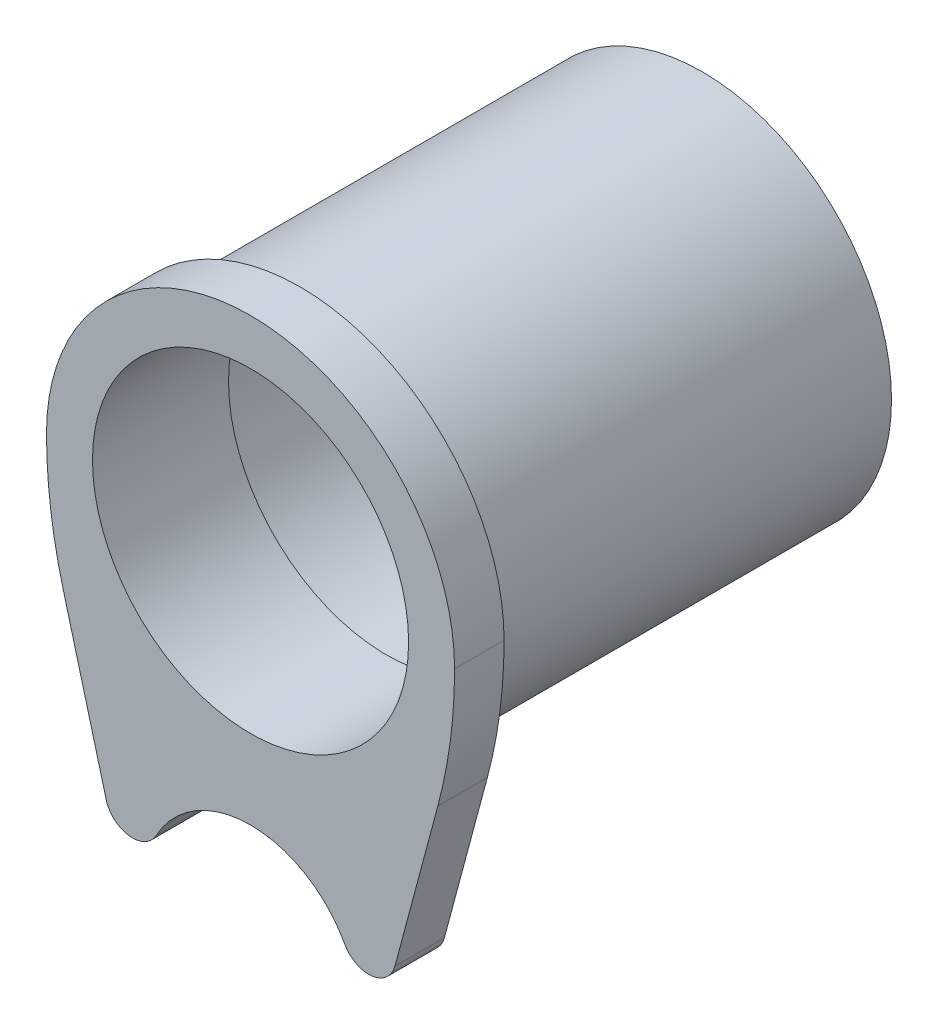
ISO-10303-21;
HEADER;
FILE_DESCRIPTION(('STEP AP214'),'2;1');
FILE_NAME('part.step','',(''),(''),'','','');
FILE_SCHEMA(('AUTOMOTIVE_DESIGN { 1 0 10303 214 1 1 1 1 }'));
ENDSEC;
DATA;
#1=APPLICATION_CONTEXT('core data for automotive mechanical design processes');
#2=APPLICATION_PROTOCOL_DEFINITION('international standard','automotive_design',2000,#1);
#3=PRODUCT_CONTEXT('',#1,'mechanical');
#4=PRODUCT('Part','Part','',(#3));
#5=PRODUCT_RELATED_PRODUCT_CATEGORY('part','',(#4));
#6=PRODUCT_DEFINITION_FORMATION('','',#4);
#7=PRODUCT_DEFINITION_CONTEXT('part definition',#1,'design');
#8=PRODUCT_DEFINITION('design','',#6,#7);
#9=PRODUCT_DEFINITION_SHAPE('','',#8);
#10=(LENGTH_UNIT() NAMED_UNIT(*) SI_UNIT(.MILLI.,.METRE.));
#11=(NAMED_UNIT(*) PLANE_ANGLE_UNIT() SI_UNIT($,.RADIAN.));
#12=(NAMED_UNIT(*) SI_UNIT($,.STERADIAN.) SOLID_ANGLE_UNIT());
#13=UNCERTAINTY_MEASURE_WITH_UNIT(LENGTH_MEASURE(1.E-05),#10,'distance_accuracy_value','');
#14=(GEOMETRIC_REPRESENTATION_CONTEXT(3) GLOBAL_UNCERTAINTY_ASSIGNED_CONTEXT((#13)) GLOBAL_UNIT_ASSIGNED_CONTEXT((#10,
#11,#12)) REPRESENTATION_CONTEXT('',''));
#15=CARTESIAN_POINT('',(0.,0.,0.));
#16=DIRECTION('',(0.,0.,1.));
#17=DIRECTION('',(1.,0.,0.));
#18=AXIS2_PLACEMENT_3D('',#15,#16,#17);
#19=CARTESIAN_POINT('',(0.,16.0782000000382,-6.9215));
#20=DIRECTION('',(0.,0.,1.));
#21=DIRECTION('',(1.,0.,0.));
#22=AXIS2_PLACEMENT_3D('',#19,#20,#21);
#23=CYLINDRICAL_SURFACE('',#22,8.8392);
#24=DIRECTION('',(0.,0.,1.));
#25=VECTOR('',#24,1.);
#26=CARTESIAN_POINT('',(-7.8045503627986,11.9284469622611,-6.9215));
#27=LINE('',#26,#25);
#28=CARTESIAN_POINT('',(-7.8045503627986,11.9284469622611,-6.6675));
#29=VERTEX_POINT('',#28);
#30=CARTESIAN_POINT('',(-7.8045503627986,11.9284469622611,-4.3307));
#31=VERTEX_POINT('',#30);
#32=EDGE_CURVE('E123',#29,#31,#27,.T.);
#33=ORIENTED_EDGE('',*,*,#32,.T.);
#34=CARTESIAN_POINT('',(0.,16.0782000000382,-4.3307));
#35=DIRECTION('',(0.,0.,1.));
#36=DIRECTION('',(1.,0.,0.));
#37=AXIS2_PLACEMENT_3D('',#34,#35,#36);
#38=CIRCLE('',#37,8.8392);
#39=CARTESIAN_POINT('',(-3.02318445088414,7.7720689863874,-4.3307));
#40=VERTEX_POINT('',#39);
#41=EDGE_CURVE('E136',#31,#40,#38,.T.);
#42=ORIENTED_EDGE('',*,*,#41,.T.);
#43=DIRECTION('',(0.,0.,1.));
#44=VECTOR('',#43,1.);
#45=CARTESIAN_POINT('',(-3.02318445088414,7.7720689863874,-6.9215));
#46=LINE('',#45,#44);
#47=CARTESIAN_POINT('',(-3.02318445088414,7.7720689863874,-6.6675));
#48=VERTEX_POINT('',#47);
#49=EDGE_CURVE('E116',#48,#40,#46,.T.);
#50=ORIENTED_EDGE('',*,*,#49,.F.);
#51=CARTESIAN_POINT('',(0.,16.0782000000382,-6.6675));
#52=DIRECTION('',(0.,0.,1.));
#53=DIRECTION('',(1.,0.,0.));
#54=AXIS2_PLACEMENT_3D('',#51,#52,#53);
#55=CIRCLE('',#54,8.8392);
#56=EDGE_CURVE('E134',#48,#29,#55,.F.);
#57=ORIENTED_EDGE('',*,*,#56,.T.);
#58=EDGE_LOOP('',(#33,#42,#50,#57));
#59=FACE_BOUND('',#58,.T.);
#60=ADVANCED_FACE('F42',(#59),#23,.F.);
#61=CARTESIAN_POINT('',(-2.49040454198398,1.95441399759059,-6.9215));
#62=DIRECTION('',(0.,0.,1.));
#63=DIRECTION('',(1.,0.,0.));
#64=AXIS2_PLACEMENT_3D('',#61,#62,#63);
#65=CYLINDRICAL_SURFACE('',#64,5.842);
#66=ORIENTED_EDGE('',*,*,#49,.T.);
#67=CARTESIAN_POINT('',(-3.02318445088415,7.7720689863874,-4.3307));
#68=CARTESIAN_POINT('',(-3.0231649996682,7.77207044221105,-4.32392297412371));
#69=CARTESIAN_POINT('',(-3.02381713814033,7.77201106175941,-4.31717257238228));
#70=CARTESIAN_POINT('',(-3.02628125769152,7.77178476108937,-4.30397268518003));
#71=CARTESIAN_POINT('',(-3.02807854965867,7.77161920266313,-4.2975204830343));
#72=CARTESIAN_POINT('',(-3.03326457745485,7.77113772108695,-4.28332485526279));
#73=CARTESIAN_POINT('',(-3.03694887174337,7.77079357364,-4.27569249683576));
#74=CARTESIAN_POINT('',(-3.04548595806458,7.76998510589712,-4.26108933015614));
#75=CARTESIAN_POINT('',(-3.05034498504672,7.76952014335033,-4.2541223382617));
#76=CARTESIAN_POINT('',(-3.0644197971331,7.76815182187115,-4.23640209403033));
#77=CARTESIAN_POINT('',(-3.0743707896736,7.76716368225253,-4.22624622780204));
#78=CARTESIAN_POINT('',(-3.09558501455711,7.76499370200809,-4.20746949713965));
#79=CARTESIAN_POINT('',(-3.10685113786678,7.76381143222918,-4.19885212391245));
#80=CARTESIAN_POINT('',(-3.1422208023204,7.75998557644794,-4.17457434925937));
#81=CARTESIAN_POINT('',(-3.16758676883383,7.75709184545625,-4.16080994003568));
#82=CARTESIAN_POINT('',(-3.21989871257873,7.75074979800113,-4.13679046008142));
#83=CARTESIAN_POINT('',(-3.24685159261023,7.74729892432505,-4.12655228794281));
#84=CARTESIAN_POINT('',(-3.29581256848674,7.74066976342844,-4.11089431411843));
#85=CARTESIAN_POINT('',(-3.31765630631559,7.73758901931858,-4.10491306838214));
#86=CARTESIAN_POINT('',(-3.3617063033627,7.73111665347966,-4.09465943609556));
#87=CARTESIAN_POINT('',(-3.38391276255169,7.72772485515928,-4.09038802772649));
#88=CARTESIAN_POINT('',(-3.42813084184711,7.72070609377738,-4.08358771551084));
#89=CARTESIAN_POINT('',(-3.4501386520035,7.71708453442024,-4.08102851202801));
#90=CARTESIAN_POINT('',(-3.49421557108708,7.7095707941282,-4.07759133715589));
#91=CARTESIAN_POINT('',(-3.5162845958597,7.7056788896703,-4.07671167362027));
#92=CARTESIAN_POINT('',(-3.53833542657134,7.70165723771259,-4.0767));
#93=B_SPLINE_CURVE_WITH_KNOTS('',3,(#67,#68,#69,#70,#71,#72,#73,#74,#75,#76,#77,#78,#79,#80,#81,
#82,#83,#84,#85,#86,#87,#88,#89,#90,#91,#92),.UNSPECIFIED.,.F.,.F.,(4,2,2,2,2,2,2,2,2,2,2,2,4),
(0.,0.0202566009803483,0.0402584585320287,0.0655620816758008,0.0910030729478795,
0.13352018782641,0.176132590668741,0.262668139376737,0.34961279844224,0.418108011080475,
0.486642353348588,0.553929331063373,0.621148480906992),.UNSPECIFIED.);
#94=CARTESIAN_POINT('',(-3.53833542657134,7.70165723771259,-4.0767));
#95=VERTEX_POINT('',#94);
#96=EDGE_CURVE('E145',#40,#95,#93,.T.);
#97=ORIENTED_EDGE('',*,*,#96,.T.);
#98=CARTESIAN_POINT('',(-2.49040454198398,1.95441399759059,-4.0767));
#99=DIRECTION('',(0.,0.,1.));
#100=DIRECTION('',(1.,0.,0.));
#101=AXIS2_PLACEMENT_3D('',#98,#99,#100);
#102=CIRCLE('',#101,5.842);
#103=CARTESIAN_POINT('',(-4.88241724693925,7.28425819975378,-4.0767));
#104=VERTEX_POINT('',#103);
#105=EDGE_CURVE('E113',#95,#104,#102,.T.);
#106=ORIENTED_EDGE('',*,*,#105,.T.);
#107=DIRECTION('',(0.,0.,1.));
#108=VECTOR('',#107,1.);
#109=CARTESIAN_POINT('',(-4.88241724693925,7.28425819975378,-6.9215));
#110=LINE('',#109,#108);
#111=CARTESIAN_POINT('',(-4.88241724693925,7.28425819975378,-6.9215));
#112=VERTEX_POINT('',#111);
#113=EDGE_CURVE('E110',#112,#104,#110,.T.);
#114=ORIENTED_EDGE('',*,*,#113,.F.);
#115=CARTESIAN_POINT('',(-2.49040454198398,1.95441399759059,-6.9215));
#116=DIRECTION('',(0.,0.,1.));
#117=DIRECTION('',(1.,0.,0.));
#118=AXIS2_PLACEMENT_3D('',#115,#116,#117);
#119=CIRCLE('',#118,5.842);
#120=CARTESIAN_POINT('',(-3.53833542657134,7.70165723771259,-6.9215));
#121=VERTEX_POINT('',#120);
#122=EDGE_CURVE('E99',#121,#112,#119,.T.);
#123=ORIENTED_EDGE('',*,*,#122,.F.);
#124=CARTESIAN_POINT('',(-3.53833542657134,7.70165723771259,-6.9215));
#125=CARTESIAN_POINT('',(-3.51709967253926,7.70553014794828,-6.9214899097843));
#126=CARTESIAN_POINT('',(-3.49584655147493,7.70928292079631,-6.92067331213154));
#127=CARTESIAN_POINT('',(-3.45339658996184,7.71653788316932,-6.91748193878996));
#128=CARTESIAN_POINT('',(-3.43219980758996,7.72003987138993,-6.91510592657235));
#129=CARTESIAN_POINT('',(-3.39022982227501,7.7267381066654,-6.90888664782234));
#130=CARTESIAN_POINT('',(-3.36945454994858,7.72993740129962,-6.90506053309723));
#131=CARTESIAN_POINT('',(-3.32820179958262,7.7360654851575,-6.89592216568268));
#132=CARTESIAN_POINT('',(-3.30772416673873,7.73899441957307,-6.89061071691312));
#133=CARTESIAN_POINT('',(-3.27014390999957,7.74417015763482,-6.8792972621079));
#134=CARTESIAN_POINT('',(-3.25298267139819,7.74645427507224,-6.87350725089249));
#135=CARTESIAN_POINT('',(-3.21899869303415,7.75082750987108,-6.86060883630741));
#136=CARTESIAN_POINT('',(-3.20217891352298,7.75291524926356,-6.85349203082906));
#137=CARTESIAN_POINT('',(-3.16303034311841,7.75760792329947,-6.83482413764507));
#138=CARTESIAN_POINT('',(-3.14100354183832,7.76011283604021,-6.82261132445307));
#139=CARTESIAN_POINT('',(-3.09944956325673,7.76461603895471,-6.79443140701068));
#140=CARTESIAN_POINT('',(-3.0798990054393,7.76661927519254,-6.77850421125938));
#141=CARTESIAN_POINT('',(-3.05801132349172,7.76877702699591,-6.75389020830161));
#142=CARTESIAN_POINT('',(-3.05300832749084,7.76926246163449,-6.74764326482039));
#143=CARTESIAN_POINT('',(-3.04387033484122,7.77013923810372,-6.73452781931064));
#144=CARTESIAN_POINT('',(-3.03973484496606,7.77053063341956,-6.72765967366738));
#145=CARTESIAN_POINT('',(-3.03317272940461,7.77114641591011,-6.71438831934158));
#146=CARTESIAN_POINT('',(-3.03058354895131,7.77138697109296,-6.70806747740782));
#147=CARTESIAN_POINT('',(-3.02649642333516,7.77176511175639,-6.69508604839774));
#148=CARTESIAN_POINT('',(-3.02499551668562,7.77190297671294,-6.68842643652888));
#149=CARTESIAN_POINT('',(-3.02349308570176,7.77204070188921,-6.6769859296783));
#150=CARTESIAN_POINT('',(-3.0231756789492,7.77206966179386,-6.67224489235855));
#151=CARTESIAN_POINT('',(-3.02318445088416,7.7720689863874,-6.6675));
#152=B_SPLINE_CURVE_WITH_KNOTS('',3,(#124,#125,#126,#127,#128,#129,#130,#131,#132,#133,#134,
#135,#136,#137,#138,#139,#140,#141,#142,#143,#144,#145,#146,#147,#148,#149,#150,#151),
.UNSPECIFIED.,.F.,.F.,(4,2,2,2,2,2,2,2,2,2,2,2,2,4),(0.,0.0647367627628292,0.129524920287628,
0.193569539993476,0.257579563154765,0.312302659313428,0.367384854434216,0.443142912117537,
0.51812172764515,0.542122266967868,0.566109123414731,0.586534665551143,0.606904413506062,
0.62112395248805),.UNSPECIFIED.);
#153=EDGE_CURVE('E139',#121,#48,#152,.T.);
#154=ORIENTED_EDGE('',*,*,#153,.T.);
#155=EDGE_LOOP('',(#66,#97,#106,#114,#123,#154));
#156=FACE_BOUND('',#155,.T.);
#157=ADVANCED_FACE('F112',(#156),#65,.F.);
#158=CARTESIAN_POINT('',(0.,16.0782000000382,-6.9215));
#159=DIRECTION('',(0.,0.,1.));
#160=DIRECTION('',(1.,0.,0.));
#161=AXIS2_PLACEMENT_3D('',#158,#159,#160);
#162=CYLINDRICAL_SURFACE('',#161,10.0584);
#163=CARTESIAN_POINT('',(0.,16.0782000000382,-4.0767));
#164=DIRECTION('',(0.,0.,-1.));
#165=DIRECTION('',(-1.,0.,0.));
#166=AXIS2_PLACEMENT_3D('',#163,#164,#165);
#167=CIRCLE('',#166,10.0584);
#168=CARTESIAN_POINT('',(-8.25281048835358,10.328197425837,-4.0767));
#169=VERTEX_POINT('',#168);
#170=EDGE_CURVE('E127',#104,#169,#167,.T.);
#171=ORIENTED_EDGE('',*,*,#170,.T.);
#172=DIRECTION('',(0.,0.,1.));
#173=VECTOR('',#172,1.);
#174=CARTESIAN_POINT('',(-8.25281048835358,10.328197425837,-6.9215));
#175=LINE('',#174,#173);
#176=CARTESIAN_POINT('',(-8.25281048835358,10.328197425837,-6.9215));
#177=VERTEX_POINT('',#176);
#178=EDGE_CURVE('E117',#177,#169,#175,.T.);
#179=ORIENTED_EDGE('',*,*,#178,.F.);
#180=CARTESIAN_POINT('',(0.,16.0782000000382,-6.9215));
#181=DIRECTION('',(0.,0.,-1.));
#182=DIRECTION('',(-1.,0.,0.));
#183=AXIS2_PLACEMENT_3D('',#180,#181,#182);
#184=CIRCLE('',#183,10.0584);
#185=EDGE_CURVE('E103',#112,#177,#184,.T.);
#186=ORIENTED_EDGE('',*,*,#185,.F.);
#187=ORIENTED_EDGE('',*,*,#113,.T.);
#188=EDGE_LOOP('',(#171,#179,#186,#187));
#189=FACE_BOUND('',#188,.T.);
#190=ADVANCED_FACE('F119',(#189),#162,.T.);
#191=CARTESIAN_POINT('',(-13.5969498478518,12.6880996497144,-6.9215));
#192=DIRECTION('',(0.,0.,1.));
#193=DIRECTION('',(1.,0.,0.));
#194=AXIS2_PLACEMENT_3D('',#191,#192,#193);
#195=CYLINDRICAL_SURFACE('',#194,5.842);
#196=CARTESIAN_POINT('',(-13.5969498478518,12.6880996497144,-4.0767));
#197=DIRECTION('',(0.,0.,1.));
#198=DIRECTION('',(1.,0.,0.));
#199=AXIS2_PLACEMENT_3D('',#196,#197,#198);
#200=CIRCLE('',#199,5.842);
#201=CARTESIAN_POINT('',(-7.87170149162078,11.5259915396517,-4.0767));
#202=VERTEX_POINT('',#201);
#203=EDGE_CURVE('E107',#169,#202,#200,.T.);
#204=ORIENTED_EDGE('',*,*,#203,.T.);
#205=CARTESIAN_POINT('',(-7.87170149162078,11.5259915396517,-4.0767));
#206=CARTESIAN_POINT('',(-7.86842263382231,11.5421443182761,-4.07670529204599));
#207=CARTESIAN_POINT('',(-7.86521559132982,11.5582964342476,-4.07740418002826));
#208=CARTESIAN_POINT('',(-7.85895557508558,11.5905314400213,-4.08016868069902));
#209=CARTESIAN_POINT('',(-7.85590276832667,11.6066142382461,-4.08223574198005));
#210=CARTESIAN_POINT('',(-7.84694571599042,11.654906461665,-4.09050779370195));
#211=CARTESIAN_POINT('',(-7.84130524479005,11.6868517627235,-4.09878298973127));
#212=CARTESIAN_POINT('',(-7.83270871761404,11.7378852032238,-4.11718180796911));
#213=CARTESIAN_POINT('',(-7.82950561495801,11.7575484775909,-4.12563549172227));
#214=CARTESIAN_POINT('',(-7.82350682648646,11.7955278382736,-4.14522841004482));
#215=CARTESIAN_POINT('',(-7.82070979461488,11.8138482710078,-4.15635843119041));
#216=CARTESIAN_POINT('',(-7.8164979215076,11.8422457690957,-4.17727410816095));
#217=CARTESIAN_POINT('',(-7.81494229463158,11.8529610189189,-4.18616301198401));
#218=CARTESIAN_POINT('',(-7.81207642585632,11.873050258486,-4.205401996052));
#219=CARTESIAN_POINT('',(-7.81076593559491,11.8824256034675,-4.2157505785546));
#220=CARTESIAN_POINT('',(-7.80876255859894,11.8969668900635,-4.23503478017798));
#221=CARTESIAN_POINT('',(-7.80799807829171,11.9025895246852,-4.24361589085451));
#222=CARTESIAN_POINT('',(-7.80667395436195,11.9124106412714,-4.2615527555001));
#223=CARTESIAN_POINT('',(-7.80611358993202,11.9166141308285,-4.2709056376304));
#224=CARTESIAN_POINT('',(-7.80531003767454,11.9226713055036,-4.28858636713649));
#225=CARTESIAN_POINT('',(-7.80502898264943,11.92480400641,-4.29681573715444));
#226=CARTESIAN_POINT('',(-7.80464735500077,11.9277072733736,-4.31358786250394));
#227=CARTESIAN_POINT('',(-7.80454841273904,11.9284655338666,-4.32213275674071));
#228=CARTESIAN_POINT('',(-7.80455036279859,11.9284469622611,-4.3307));
#229=B_SPLINE_CURVE_WITH_KNOTS('',3,(#205,#206,#207,#208,#209,#210,#211,#212,#213,#214,#215,
#216,#217,#218,#219,#220,#221,#222,#223,#224,#225,#226,#227,#228),.UNSPECIFIED.,.F.,.F.,(4,2,2,
2,2,2,2,2,2,2,2,4),(0.,0.0494032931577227,0.0988589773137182,0.198702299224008,
0.263479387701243,0.328036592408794,0.369960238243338,0.411841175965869,0.44260091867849,
0.473250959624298,0.498656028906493,0.524287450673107),.UNSPECIFIED.);
#230=EDGE_CURVE('E51',#202,#31,#229,.T.);
#231=ORIENTED_EDGE('',*,*,#230,.T.);
#232=ORIENTED_EDGE('',*,*,#32,.F.);
#233=CARTESIAN_POINT('',(-7.80455036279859,11.9284469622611,-6.6675));
#234=CARTESIAN_POINT('',(-7.80454651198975,11.9284834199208,-6.67792185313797));
#235=CARTESIAN_POINT('',(-7.8046937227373,11.927353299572,-6.68829277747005));
#236=CARTESIAN_POINT('',(-7.80525280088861,11.9231052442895,-6.7084729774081));
#237=CARTESIAN_POINT('',(-7.80566105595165,11.9200144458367,-6.71828795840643));
#238=CARTESIAN_POINT('',(-7.80670356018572,11.9121961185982,-6.73714276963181));
#239=CARTESIAN_POINT('',(-7.80733652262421,11.9074779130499,-6.74618665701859));
#240=CARTESIAN_POINT('',(-7.80879143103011,11.8967616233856,-6.76349344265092));
#241=CARTESIAN_POINT('',(-7.80961407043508,11.8907588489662,-6.7717533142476));
#242=CARTESIAN_POINT('',(-7.81196929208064,11.8738059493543,-6.79228152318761));
#243=CARTESIAN_POINT('',(-7.81362749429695,11.8620824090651,-6.80389399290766));
#244=CARTESIAN_POINT('',(-7.81725865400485,11.8370439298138,-6.8251786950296));
#245=CARTESIAN_POINT('',(-7.81923236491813,11.8237252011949,-6.8348461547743));
#246=CARTESIAN_POINT('',(-7.82469752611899,11.787787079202,-6.85771778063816));
#247=CARTESIAN_POINT('',(-7.82839238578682,11.7643560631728,-6.86959512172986));
#248=CARTESIAN_POINT('',(-7.83633651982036,11.7160381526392,-6.88959787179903));
#249=CARTESIAN_POINT('',(-7.84058692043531,11.6911483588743,-6.89771550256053));
#250=CARTESIAN_POINT('',(-7.84916565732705,11.6428802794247,-6.90988167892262));
#251=CARTESIAN_POINT('',(-7.85345188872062,11.6195699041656,-6.9142327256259));
#252=CARTESIAN_POINT('',(-7.86234448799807,11.5728253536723,-6.92001917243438));
#253=CARTESIAN_POINT('',(-7.86694834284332,11.5493932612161,-6.92147523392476));
#254=CARTESIAN_POINT('',(-7.87170149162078,11.5259915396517,-6.9215));
#255=B_SPLINE_CURVE_WITH_KNOTS('',3,(#233,#234,#235,#236,#237,#238,#239,#240,#241,#242,#243,
#244,#245,#246,#247,#248,#249,#250,#251,#252,#253,#254),.UNSPECIFIED.,.F.,.F.,(4,2,2,2,2,2,2,2,
2,2,4),(0.,0.031122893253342,0.0618241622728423,0.0923523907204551,0.122994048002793,
0.172465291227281,0.222056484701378,0.301208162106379,0.380522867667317,0.452637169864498,
0.524234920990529),.UNSPECIFIED.);
#256=CARTESIAN_POINT('',(-7.87170149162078,11.5259915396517,-6.9215));
#257=VERTEX_POINT('',#256);
#258=EDGE_CURVE('E58',#29,#257,#255,.T.);
#259=ORIENTED_EDGE('',*,*,#258,.T.);
#260=CARTESIAN_POINT('',(-13.5969498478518,12.6880996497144,-6.9215));
#261=DIRECTION('',(0.,0.,1.));
#262=DIRECTION('',(1.,0.,0.));
#263=AXIS2_PLACEMENT_3D('',#260,#261,#262);
#264=CIRCLE('',#263,5.842);
#265=EDGE_CURVE('E121',#177,#257,#264,.T.);
#266=ORIENTED_EDGE('',*,*,#265,.F.);
#267=ORIENTED_EDGE('',*,*,#178,.T.);
#268=EDGE_LOOP('',(#204,#231,#232,#259,#266,#267));
#269=FACE_BOUND('',#268,.T.);
#270=ADVANCED_FACE('F171',(#269),#195,.F.);
#271=CARTESIAN_POINT('',(-1.24520227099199,9.01630699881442,-6.9215));
#272=DIRECTION('',(0.,0.,1.));
#273=DIRECTION('',(1.,0.,0.));
#274=AXIS2_PLACEMENT_3D('',#271,#272,#273);
#275=PLANE('',#274);
#276=ORIENTED_EDGE('',*,*,#265,.T.);
#277=CARTESIAN_POINT('',(0.,16.0782000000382,-6.9215));
#278=DIRECTION('',(0.,0.,1.));
#279=DIRECTION('',(1.,0.,0.));
#280=AXIS2_PLACEMENT_3D('',#277,#278,#279);
#281=CIRCLE('',#280,9.0932);
#282=EDGE_CURVE('E12',#257,#121,#281,.T.);
#283=ORIENTED_EDGE('',*,*,#282,.T.);
#284=ORIENTED_EDGE('',*,*,#122,.T.);
#285=ORIENTED_EDGE('',*,*,#185,.T.);
#286=EDGE_LOOP('',(#276,#283,#284,#285));
#287=FACE_BOUND('',#286,.T.);
#288=ADVANCED_FACE('F101',(#287),#275,.F.);
#289=CARTESIAN_POINT('',(-1.24520227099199,9.01630699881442,-4.0767));
#290=DIRECTION('',(0.,0.,1.));
#291=DIRECTION('',(1.,0.,0.));
#292=AXIS2_PLACEMENT_3D('',#289,#290,#291);
#293=PLANE('',#292);
#294=ORIENTED_EDGE('',*,*,#105,.F.);
#295=CARTESIAN_POINT('',(0.,16.0782000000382,-4.0767));
#296=DIRECTION('',(0.,0.,1.));
#297=DIRECTION('',(1.,0.,0.));
#298=AXIS2_PLACEMENT_3D('',#295,#296,#297);
#299=CIRCLE('',#298,9.0932);
#300=EDGE_CURVE('E66',#95,#202,#299,.F.);
#301=ORIENTED_EDGE('',*,*,#300,.T.);
#302=ORIENTED_EDGE('',*,*,#203,.F.);
#303=ORIENTED_EDGE('',*,*,#170,.F.);
#304=EDGE_LOOP('',(#294,#301,#302,#303));
#305=FACE_BOUND('',#304,.T.);
#306=ADVANCED_FACE('F161',(#305),#293,.T.);
#307=CARTESIAN_POINT('',(0.,16.0782000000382,-4.3307));
#308=DIRECTION('',(0.,0.,1.));
#309=DIRECTION('',(1.,0.,0.));
#310=AXIS2_PLACEMENT_3D('',#307,#308,#309);
#311=TOROIDAL_SURFACE('',#310,9.0932,0.254);
#312=ORIENTED_EDGE('',*,*,#230,.F.);
#313=ORIENTED_EDGE('',*,*,#300,.F.);
#314=ORIENTED_EDGE('',*,*,#96,.F.);
#315=ORIENTED_EDGE('',*,*,#41,.F.);
#316=EDGE_LOOP('',(#312,#313,#314,#315));
#317=FACE_BOUND('',#316,.T.);
#318=ADVANCED_FACE('F158',(#317),#311,.T.);
#319=CARTESIAN_POINT('',(0.,16.0782000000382,-6.6675));
#320=DIRECTION('',(0.,0.,1.));
#321=DIRECTION('',(1.,0.,0.));
#322=AXIS2_PLACEMENT_3D('',#319,#320,#321);
#323=TOROIDAL_SURFACE('',#322,9.0932,0.254);
#324=ORIENTED_EDGE('',*,*,#258,.F.);
#325=ORIENTED_EDGE('',*,*,#56,.F.);
#326=ORIENTED_EDGE('',*,*,#153,.F.);
#327=ORIENTED_EDGE('',*,*,#282,.F.);
#328=EDGE_LOOP('',(#324,#325,#326,#327));
#329=FACE_BOUND('',#328,.T.);
#330=ADVANCED_FACE('F44',(#329),#323,.T.);
#331=CLOSED_SHELL('',(#60,#157,#190,#270,#288,#306,#318,#330));
#332=MANIFOLD_SOLID_BREP('B2',#331);
#333=CARTESIAN_POINT('',(0.,16.0782000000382,1.1557));
#334=DIRECTION('',(0.,0.,-1.));
#335=DIRECTION('',(-1.,0.,0.));
#336=AXIS2_PLACEMENT_3D('',#333,#334,#335);
#337=CYLINDRICAL_SURFACE('',#336,7.37869999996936);
#338=CARTESIAN_POINT('',(0.,16.0782000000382,1.1557));
#339=DIRECTION('',(0.,0.,1.));
#340=DIRECTION('',(1.,0.,0.));
#341=AXIS2_PLACEMENT_3D('',#338,#339,#340);
#342=CIRCLE('',#341,7.37869999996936);
#343=CARTESIAN_POINT('',(7.37869999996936,16.0782000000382,1.1557));
#344=VERTEX_POINT('',#343);
#345=EDGE_CURVE('E339',#344,#344,#342,.T.);
#346=ORIENTED_EDGE('',*,*,#345,.T.);
#347=EDGE_LOOP('',(#346));
#348=FACE_BOUND('',#347,.T.);
#349=CARTESIAN_POINT('',(0.,16.0782000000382,-5.1943));
#350=DIRECTION('',(0.,0.,-1.));
#351=DIRECTION('',(-1.,0.,0.));
#352=AXIS2_PLACEMENT_3D('',#349,#350,#351);
#353=CIRCLE('',#352,7.37869999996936);
#354=CARTESIAN_POINT('',(-7.37869999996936,16.0782000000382,-5.1943));
#355=VERTEX_POINT('',#354);
#356=EDGE_CURVE('E368',#355,#355,#353,.T.);
#357=ORIENTED_EDGE('',*,*,#356,.T.);
#358=EDGE_LOOP('',(#357));
#359=FACE_BOUND('',#358,.T.);
#360=ADVANCED_FACE('F237',(#348,#359),#337,.F.);
#361=CARTESIAN_POINT('',(0.,16.0782000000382,-19.9263));
#362=DIRECTION('',(0.,0.,-1.));
#363=DIRECTION('',(-1.,0.,0.));
#364=AXIS2_PLACEMENT_3D('',#361,#362,#363);
#365=PLANE('',#364);
#366=CARTESIAN_POINT('',(0.,16.0782000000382,-19.9263));
#367=DIRECTION('',(0.,0.,-1.));
#368=DIRECTION('',(-1.,0.,0.));
#369=AXIS2_PLACEMENT_3D('',#366,#367,#368);
#370=CIRCLE('',#369,8.8392);
#371=CARTESIAN_POINT('',(-8.8392,16.0782000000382,-19.9263));
#372=VERTEX_POINT('',#371);
#373=EDGE_CURVE('E371',#372,#372,#370,.T.);
#374=ORIENTED_EDGE('',*,*,#373,.T.);
#375=EDGE_LOOP('',(#374));
#376=FACE_BOUND('',#375,.T.);
#377=CARTESIAN_POINT('',(0.,16.0782000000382,-19.9263));
#378=DIRECTION('',(0.,0.,-1.));
#379=DIRECTION('',(-1.,0.,0.));
#380=AXIS2_PLACEMENT_3D('',#377,#378,#379);
#381=CIRCLE('',#380,7.747);
#382=CARTESIAN_POINT('',(-7.747,16.0782000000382,-19.9263));
#383=VERTEX_POINT('',#382);
#384=EDGE_CURVE('E365',#383,#383,#381,.F.);
#385=ORIENTED_EDGE('',*,*,#384,.T.);
#386=EDGE_LOOP('',(#385));
#387=FACE_BOUND('',#386,.T.);
#388=ADVANCED_FACE('F389',(#376,#387),#365,.T.);
#389=CARTESIAN_POINT('',(-5.51336853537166,2.99388273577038,-1.1557));
#390=DIRECTION('',(0.,0.,-1.));
#391=DIRECTION('',(-1.,0.,0.));
#392=AXIS2_PLACEMENT_3D('',#389,#390,#391);
#393=PLANE('',#392);
#394=CARTESIAN_POINT('',(0.,16.0782000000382,-1.1557));
#395=DIRECTION('',(0.,0.,-1.));
#396=DIRECTION('',(-1.,0.,0.));
#397=AXIS2_PLACEMENT_3D('',#394,#395,#396);
#398=CIRCLE('',#397,9.2202);
#399=CARTESIAN_POINT('',(-9.2202,16.0782000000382,-1.1557));
#400=VERTEX_POINT('',#399);
#401=EDGE_CURVE('E246',#400,#400,#398,.F.);
#402=ORIENTED_EDGE('',*,*,#401,.T.);
#403=EDGE_LOOP('',(#402));
#404=FACE_BOUND('',#403,.T.);
#405=CARTESIAN_POINT('',(-5.51336853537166,2.99388273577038,-1.1557));
#406=DIRECTION('',(0.,0.,1.));
#407=DIRECTION('',(-1.,0.,0.));
#408=AXIS2_PLACEMENT_3D('',#405,#406,#407);
#409=CIRCLE('',#408,1.27000000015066);
#410=CARTESIAN_POINT('',(-6.7400943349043,2.66518254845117,-1.1557));
#411=VERTEX_POINT('',#410);
#412=CARTESIAN_POINT('',(-4.39730203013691,2.38783359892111,-1.1557));
#413=VERTEX_POINT('',#412);
#414=EDGE_CURVE('E335',#411,#413,#409,.T.);
#415=ORIENTED_EDGE('',*,*,#414,.F.);
#416=DIRECTION('',(0.258819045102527,-0.965925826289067,0.));
#417=VECTOR('',#416,1.);
#418=CARTESIAN_POINT('',(-6.7400943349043,2.66518254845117,-1.1557));
#419=LINE('',#418,#417);
#420=CARTESIAN_POINT('',(-8.74346793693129,10.141874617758,-1.1557));
#421=VERTEX_POINT('',#420);
#422=EDGE_CURVE('E289',#421,#411,#419,.T.);
#423=ORIENTED_EDGE('',*,*,#422,.F.);
#424=CARTESIAN_POINT('',(13.4112,16.0782000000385,-1.1557));
#425=DIRECTION('',(0.,0.,1.));
#426=DIRECTION('',(-1.,0.,0.));
#427=AXIS2_PLACEMENT_3D('',#424,#425,#426);
#428=CIRCLE('',#427,22.9362);
#429=CARTESIAN_POINT('',(-9.525,16.078200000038,-1.1557));
#430=VERTEX_POINT('',#429);
#431=EDGE_CURVE('E283',#430,#421,#428,.T.);
#432=ORIENTED_EDGE('',*,*,#431,.F.);
#433=CARTESIAN_POINT('',(0.,16.0782000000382,-1.1557));
#434=DIRECTION('',(0.,0.,1.));
#435=DIRECTION('',(-1.,0.,0.));
#436=AXIS2_PLACEMENT_3D('',#433,#434,#435);
#437=CIRCLE('',#436,9.525);
#438=CARTESIAN_POINT('',(9.525,16.0782000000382,-1.1557));
#439=VERTEX_POINT('',#438);
#440=EDGE_CURVE('E325',#439,#430,#437,.T.);
#441=ORIENTED_EDGE('',*,*,#440,.F.);
#442=CARTESIAN_POINT('',(-13.4112,16.0782000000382,-1.1557));
#443=DIRECTION('',(0.,0.,1.));
#444=DIRECTION('',(1.,0.,0.));
#445=AXIS2_PLACEMENT_3D('',#442,#443,#444);
#446=CIRCLE('',#445,22.9362);
#447=CARTESIAN_POINT('',(8.74346793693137,10.141874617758,-1.1557));
#448=VERTEX_POINT('',#447);
#449=EDGE_CURVE('E345',#448,#439,#446,.T.);
#450=ORIENTED_EDGE('',*,*,#449,.F.);
#451=DIRECTION('',(0.258819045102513,0.96592582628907,0.));
#452=VECTOR('',#451,1.);
#453=CARTESIAN_POINT('',(6.74009433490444,2.66518254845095,-1.1557));
#454=LINE('',#453,#452);
#455=CARTESIAN_POINT('',(6.74009433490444,2.66518254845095,-1.1557));
#456=VERTEX_POINT('',#455);
#457=EDGE_CURVE('E343',#456,#448,#454,.T.);
#458=ORIENTED_EDGE('',*,*,#457,.F.);
#459=CARTESIAN_POINT('',(5.51336853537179,2.99388273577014,-1.1557));
#460=DIRECTION('',(0.,0.,1.));
#461=DIRECTION('',(1.,0.,0.));
#462=AXIS2_PLACEMENT_3D('',#459,#460,#461);
#463=CIRCLE('',#462,1.27000000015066);
#464=CARTESIAN_POINT('',(4.39730203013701,2.38783359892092,-1.1557));
#465=VERTEX_POINT('',#464);
#466=EDGE_CURVE('E341',#465,#456,#463,.T.);
#467=ORIENTED_EDGE('',*,*,#466,.F.);
#468=CARTESIAN_POINT('',(0.,0.,-1.1557));
#469=DIRECTION('',(0.,0.,-1.));
#470=DIRECTION('',(-1.,0.,0.));
#471=AXIS2_PLACEMENT_3D('',#468,#469,#470);
#472=CIRCLE('',#471,5.00380000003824);
#473=EDGE_CURVE('E338',#413,#465,#472,.T.);
#474=ORIENTED_EDGE('',*,*,#473,.F.);
#475=EDGE_LOOP('',(#415,#423,#432,#441,#450,#458,#467,#474));
#476=FACE_BOUND('',#475,.T.);
#477=ADVANCED_FACE('F375',(#404,#476),#393,.T.);
#478=CARTESIAN_POINT('',(-5.51336853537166,2.99388273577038,1.1557));
#479=DIRECTION('',(0.,0.,-1.));
#480=DIRECTION('',(-1.,0.,0.));
#481=AXIS2_PLACEMENT_3D('',#478,#479,#480);
#482=PLANE('',#481);
#483=ORIENTED_EDGE('',*,*,#345,.F.);
#484=EDGE_LOOP('',(#483));
#485=FACE_BOUND('',#484,.T.);
#486=CARTESIAN_POINT('',(-5.51336853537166,2.99388273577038,1.1557));
#487=DIRECTION('',(0.,0.,1.));
#488=DIRECTION('',(-1.,0.,0.));
#489=AXIS2_PLACEMENT_3D('',#486,#487,#488);
#490=CIRCLE('',#489,1.27000000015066);
#491=CARTESIAN_POINT('',(-6.7400943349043,2.66518254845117,1.1557));
#492=VERTEX_POINT('',#491);
#493=CARTESIAN_POINT('',(-4.39730203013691,2.38783359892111,1.1557));
#494=VERTEX_POINT('',#493);
#495=EDGE_CURVE('E350',#492,#494,#490,.T.);
#496=ORIENTED_EDGE('',*,*,#495,.T.);
#497=CARTESIAN_POINT('',(0.,0.,1.1557));
#498=DIRECTION('',(0.,0.,-1.));
#499=DIRECTION('',(-1.,0.,0.));
#500=AXIS2_PLACEMENT_3D('',#497,#498,#499);
#501=CIRCLE('',#500,5.00380000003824);
#502=CARTESIAN_POINT('',(4.39730203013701,2.38783359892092,1.1557));
#503=VERTEX_POINT('',#502);
#504=EDGE_CURVE('E298',#494,#503,#501,.T.);
#505=ORIENTED_EDGE('',*,*,#504,.T.);
#506=CARTESIAN_POINT('',(5.51336853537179,2.99388273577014,1.1557));
#507=DIRECTION('',(0.,0.,1.));
#508=DIRECTION('',(1.,0.,0.));
#509=AXIS2_PLACEMENT_3D('',#506,#507,#508);
#510=CIRCLE('',#509,1.27000000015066);
#511=CARTESIAN_POINT('',(6.74009433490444,2.66518254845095,1.1557));
#512=VERTEX_POINT('',#511);
#513=EDGE_CURVE('E440',#503,#512,#510,.T.);
#514=ORIENTED_EDGE('',*,*,#513,.T.);
#515=DIRECTION('',(0.258819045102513,0.96592582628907,0.));
#516=VECTOR('',#515,1.);
#517=CARTESIAN_POINT('',(6.74009433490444,2.66518254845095,1.1557));
#518=LINE('',#517,#516);
#519=CARTESIAN_POINT('',(8.74346793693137,10.141874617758,1.1557));
#520=VERTEX_POINT('',#519);
#521=EDGE_CURVE('E442',#512,#520,#518,.T.);
#522=ORIENTED_EDGE('',*,*,#521,.T.);
#523=CARTESIAN_POINT('',(-13.4112,16.0782000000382,1.1557));
#524=DIRECTION('',(0.,0.,1.));
#525=DIRECTION('',(1.,0.,0.));
#526=AXIS2_PLACEMENT_3D('',#523,#524,#525);
#527=CIRCLE('',#526,22.9362);
#528=CARTESIAN_POINT('',(9.525,16.0782000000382,1.1557));
#529=VERTEX_POINT('',#528);
#530=EDGE_CURVE('E317',#520,#529,#527,.T.);
#531=ORIENTED_EDGE('',*,*,#530,.T.);
#532=CARTESIAN_POINT('',(0.,16.0782000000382,1.1557));
#533=DIRECTION('',(0.,0.,1.));
#534=DIRECTION('',(-1.,0.,0.));
#535=AXIS2_PLACEMENT_3D('',#532,#533,#534);
#536=CIRCLE('',#535,9.525);
#537=CARTESIAN_POINT('',(-9.525,16.078200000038,1.1557));
#538=VERTEX_POINT('',#537);
#539=EDGE_CURVE('E311',#529,#538,#536,.T.);
#540=ORIENTED_EDGE('',*,*,#539,.T.);
#541=CARTESIAN_POINT('',(13.4112,16.0782000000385,1.1557));
#542=DIRECTION('',(0.,0.,1.));
#543=DIRECTION('',(-1.,0.,0.));
#544=AXIS2_PLACEMENT_3D('',#541,#542,#543);
#545=CIRCLE('',#544,22.9362);
#546=CARTESIAN_POINT('',(-8.74346793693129,10.141874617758,1.1557));
#547=VERTEX_POINT('',#546);
#548=EDGE_CURVE('E315',#538,#547,#545,.T.);
#549=ORIENTED_EDGE('',*,*,#548,.T.);
#550=DIRECTION('',(0.258819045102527,-0.965925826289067,0.));
#551=VECTOR('',#550,1.);
#552=CARTESIAN_POINT('',(-6.7400943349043,2.66518254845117,1.1557));
#553=LINE('',#552,#551);
#554=EDGE_CURVE('E254',#547,#492,#553,.T.);
#555=ORIENTED_EDGE('',*,*,#554,.T.);
#556=EDGE_LOOP('',(#496,#505,#514,#522,#531,#540,#549,#555));
#557=FACE_BOUND('',#556,.T.);
#558=ADVANCED_FACE('F313',(#485,#557),#482,.F.);
#559=CARTESIAN_POINT('',(-5.51336853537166,2.99388273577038,1.1557));
#560=DIRECTION('',(0.,0.,-1.));
#561=DIRECTION('',(-1.,0.,0.));
#562=AXIS2_PLACEMENT_3D('',#559,#560,#561);
#563=CYLINDRICAL_SURFACE('',#562,1.27000000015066);
#564=ORIENTED_EDGE('',*,*,#414,.T.);
#565=DIRECTION('',(0.,0.,-1.));
#566=VECTOR('',#565,1.);
#567=CARTESIAN_POINT('',(-4.39730203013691,2.38783359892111,1.1557));
#568=LINE('',#567,#566);
#569=EDGE_CURVE('E363',#494,#413,#568,.T.);
#570=ORIENTED_EDGE('',*,*,#569,.F.);
#571=ORIENTED_EDGE('',*,*,#495,.F.);
#572=DIRECTION('',(0.,0.,-1.));
#573=VECTOR('',#572,1.);
#574=CARTESIAN_POINT('',(-6.7400943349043,2.66518254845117,1.1557));
#575=LINE('',#574,#573);
#576=EDGE_CURVE('E331',#492,#411,#575,.T.);
#577=ORIENTED_EDGE('',*,*,#576,.T.);
#578=EDGE_LOOP('',(#564,#570,#571,#577));
#579=FACE_BOUND('',#578,.T.);
#580=ADVANCED_FACE('F404',(#579),#563,.T.);
#581=CARTESIAN_POINT('',(0.,0.,1.1557));
#582=DIRECTION('',(0.,0.,-1.));
#583=DIRECTION('',(-1.,0.,0.));
#584=AXIS2_PLACEMENT_3D('',#581,#582,#583);
#585=CYLINDRICAL_SURFACE('',#584,5.00380000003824);
#586=ORIENTED_EDGE('',*,*,#473,.T.);
#587=DIRECTION('',(0.,0.,-1.));
#588=VECTOR('',#587,1.);
#589=CARTESIAN_POINT('',(4.39730203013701,2.38783359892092,1.1557));
#590=LINE('',#589,#588);
#591=EDGE_CURVE('E360',#503,#465,#590,.T.);
#592=ORIENTED_EDGE('',*,*,#591,.F.);
#593=ORIENTED_EDGE('',*,*,#504,.F.);
#594=ORIENTED_EDGE('',*,*,#569,.T.);
#595=EDGE_LOOP('',(#586,#592,#593,#594));
#596=FACE_BOUND('',#595,.T.);
#597=ADVANCED_FACE('F426',(#596),#585,.F.);
#598=CARTESIAN_POINT('',(5.51336853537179,2.99388273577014,1.1557));
#599=DIRECTION('',(0.,0.,-1.));
#600=DIRECTION('',(-1.,0.,0.));
#601=AXIS2_PLACEMENT_3D('',#598,#599,#600);
#602=CYLINDRICAL_SURFACE('',#601,1.27000000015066);
#603=ORIENTED_EDGE('',*,*,#466,.T.);
#604=DIRECTION('',(0.,0.,-1.));
#605=VECTOR('',#604,1.);
#606=CARTESIAN_POINT('',(6.74009433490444,2.66518254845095,1.1557));
#607=LINE('',#606,#605);
#608=EDGE_CURVE('E357',#512,#456,#607,.T.);
#609=ORIENTED_EDGE('',*,*,#608,.F.);
#610=ORIENTED_EDGE('',*,*,#513,.F.);
#611=ORIENTED_EDGE('',*,*,#591,.T.);
#612=EDGE_LOOP('',(#603,#609,#610,#611));
#613=FACE_BOUND('',#612,.T.);
#614=ADVANCED_FACE('F422',(#613),#602,.T.);
#615=CARTESIAN_POINT('',(6.74009433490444,2.66518254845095,1.1557));
#616=DIRECTION('',(-0.96592582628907,0.258819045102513,0.));
#617=DIRECTION('',(-0.258819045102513,-0.96592582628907,0.));
#618=AXIS2_PLACEMENT_3D('',#615,#616,#617);
#619=PLANE('',#618);
#620=ORIENTED_EDGE('',*,*,#457,.T.);
#621=DIRECTION('',(0.,0.,-1.));
#622=VECTOR('',#621,1.);
#623=CARTESIAN_POINT('',(8.74346793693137,10.141874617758,1.1557));
#624=LINE('',#623,#622);
#625=EDGE_CURVE('E354',#520,#448,#624,.T.);
#626=ORIENTED_EDGE('',*,*,#625,.F.);
#627=ORIENTED_EDGE('',*,*,#521,.F.);
#628=ORIENTED_EDGE('',*,*,#608,.T.);
#629=EDGE_LOOP('',(#620,#626,#627,#628));
#630=FACE_BOUND('',#629,.T.);
#631=ADVANCED_FACE('F418',(#630),#619,.F.);
#632=CARTESIAN_POINT('',(-13.4112,16.0782000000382,1.1557));
#633=DIRECTION('',(0.,0.,-1.));
#634=DIRECTION('',(-1.,0.,0.));
#635=AXIS2_PLACEMENT_3D('',#632,#633,#634);
#636=CYLINDRICAL_SURFACE('',#635,22.9362);
#637=ORIENTED_EDGE('',*,*,#449,.T.);
#638=DIRECTION('',(0.,0.,-1.));
#639=VECTOR('',#638,1.);
#640=CARTESIAN_POINT('',(9.525,16.0782000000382,1.1557));
#641=LINE('',#640,#639);
#642=EDGE_CURVE('E326',#529,#439,#641,.T.);
#643=ORIENTED_EDGE('',*,*,#642,.F.);
#644=ORIENTED_EDGE('',*,*,#530,.F.);
#645=ORIENTED_EDGE('',*,*,#625,.T.);
#646=EDGE_LOOP('',(#637,#643,#644,#645));
#647=FACE_BOUND('',#646,.T.);
#648=ADVANCED_FACE('F415',(#647),#636,.T.);
#649=CARTESIAN_POINT('',(0.,16.0782000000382,1.1557));
#650=DIRECTION('',(0.,0.,-1.));
#651=DIRECTION('',(-1.,0.,0.));
#652=AXIS2_PLACEMENT_3D('',#649,#650,#651);
#653=CYLINDRICAL_SURFACE('',#652,9.525);
#654=ORIENTED_EDGE('',*,*,#440,.T.);
#655=DIRECTION('',(0.,0.,-1.));
#656=VECTOR('',#655,1.);
#657=CARTESIAN_POINT('',(-9.525,16.078200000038,1.1557));
#658=LINE('',#657,#656);
#659=EDGE_CURVE('E322',#538,#430,#658,.T.);
#660=ORIENTED_EDGE('',*,*,#659,.F.);
#661=ORIENTED_EDGE('',*,*,#539,.F.);
#662=ORIENTED_EDGE('',*,*,#642,.T.);
#663=EDGE_LOOP('',(#654,#660,#661,#662));
#664=FACE_BOUND('',#663,.T.);
#665=ADVANCED_FACE('F323',(#664),#653,.T.);
#666=CARTESIAN_POINT('',(13.4112,16.0782000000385,1.1557));
#667=DIRECTION('',(0.,0.,-1.));
#668=DIRECTION('',(-1.,0.,0.));
#669=AXIS2_PLACEMENT_3D('',#666,#667,#668);
#670=CYLINDRICAL_SURFACE('',#669,22.9362);
#671=ORIENTED_EDGE('',*,*,#431,.T.);
#672=DIRECTION('',(0.,0.,-1.));
#673=VECTOR('',#672,1.);
#674=CARTESIAN_POINT('',(-8.74346793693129,10.141874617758,1.1557));
#675=LINE('',#674,#673);
#676=EDGE_CURVE('E327',#547,#421,#675,.T.);
#677=ORIENTED_EDGE('',*,*,#676,.F.);
#678=ORIENTED_EDGE('',*,*,#548,.F.);
#679=ORIENTED_EDGE('',*,*,#659,.T.);
#680=EDGE_LOOP('',(#671,#677,#678,#679));
#681=FACE_BOUND('',#680,.T.);
#682=ADVANCED_FACE('F329',(#681),#670,.T.);
#683=CARTESIAN_POINT('',(-6.7400943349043,2.66518254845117,1.1557));
#684=DIRECTION('',(0.965925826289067,0.258819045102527,0.));
#685=DIRECTION('',(-0.258819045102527,0.965925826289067,0.));
#686=AXIS2_PLACEMENT_3D('',#683,#684,#685);
#687=PLANE('',#686);
#688=ORIENTED_EDGE('',*,*,#422,.T.);
#689=ORIENTED_EDGE('',*,*,#576,.F.);
#690=ORIENTED_EDGE('',*,*,#554,.F.);
#691=ORIENTED_EDGE('',*,*,#676,.T.);
#692=EDGE_LOOP('',(#688,#689,#690,#691));
#693=FACE_BOUND('',#692,.T.);
#694=ADVANCED_FACE('F408',(#693),#687,.F.);
#695=CARTESIAN_POINT('',(0.,16.0782000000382,-19.9263));
#696=DIRECTION('',(0.,0.,1.));
#697=DIRECTION('',(1.,0.,0.));
#698=AXIS2_PLACEMENT_3D('',#695,#696,#697);
#699=CYLINDRICAL_SURFACE('',#698,8.8392);
#700=CARTESIAN_POINT('',(0.,16.0782000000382,-1.5367));
#701=DIRECTION('',(0.,0.,-1.));
#702=DIRECTION('',(-1.,0.,0.));
#703=AXIS2_PLACEMENT_3D('',#700,#701,#702);
#704=CIRCLE('',#703,8.8392);
#705=CARTESIAN_POINT('',(-8.8392,16.0782000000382,-1.5367));
#706=VERTEX_POINT('',#705);
#707=EDGE_CURVE('E40',#706,#706,#704,.T.);
#708=ORIENTED_EDGE('',*,*,#707,.T.);
#709=EDGE_LOOP('',(#708));
#710=FACE_BOUND('',#709,.T.);
#711=ORIENTED_EDGE('',*,*,#373,.F.);
#712=EDGE_LOOP('',(#711));
#713=FACE_BOUND('',#712,.T.);
#714=ADVANCED_FACE('F401',(#710,#713),#699,.T.);
#715=CARTESIAN_POINT('',(0.,16.0782000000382,-26.2763));
#716=DIRECTION('',(0.,0.,1.));
#717=DIRECTION('',(1.,0.,0.));
#718=AXIS2_PLACEMENT_3D('',#715,#716,#717);
#719=CYLINDRICAL_SURFACE('',#718,7.747);
#720=ORIENTED_EDGE('',*,*,#384,.F.);
#721=EDGE_LOOP('',(#720));
#722=FACE_BOUND('',#721,.T.);
#723=CARTESIAN_POINT('',(0.,16.0782000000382,-5.1943));
#724=DIRECTION('',(0.,0.,-1.));
#725=DIRECTION('',(-1.,0.,0.));
#726=AXIS2_PLACEMENT_3D('',#723,#724,#725);
#727=CIRCLE('',#726,7.747);
#728=CARTESIAN_POINT('',(-7.747,16.0782000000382,-5.1943));
#729=VERTEX_POINT('',#728);
#730=EDGE_CURVE('E369',#729,#729,#727,.T.);
#731=ORIENTED_EDGE('',*,*,#730,.F.);
#732=EDGE_LOOP('',(#731));
#733=FACE_BOUND('',#732,.T.);
#734=ADVANCED_FACE('F384',(#722,#733),#719,.F.);
#735=CARTESIAN_POINT('',(0.,16.0782000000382,-5.1943));
#736=DIRECTION('',(0.,0.,-1.));
#737=DIRECTION('',(-1.,0.,0.));
#738=AXIS2_PLACEMENT_3D('',#735,#736,#737);
#739=PLANE('',#738);
#740=ORIENTED_EDGE('',*,*,#356,.F.);
#741=EDGE_LOOP('',(#740));
#742=FACE_BOUND('',#741,.T.);
#743=ORIENTED_EDGE('',*,*,#730,.T.);
#744=EDGE_LOOP('',(#743));
#745=FACE_BOUND('',#744,.T.);
#746=ADVANCED_FACE('F379',(#742,#745),#739,.T.);
#747=CARTESIAN_POINT('',(0.,16.0782000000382,-1.5367));
#748=DIRECTION('',(0.,0.,-1.));
#749=DIRECTION('',(-1.,0.,0.));
#750=AXIS2_PLACEMENT_3D('',#747,#748,#749);
#751=TOROIDAL_SURFACE('',#750,9.2202,0.381);
#752=ORIENTED_EDGE('',*,*,#707,.F.);
#753=EDGE_LOOP('',(#752));
#754=FACE_BOUND('',#753,.T.);
#755=ORIENTED_EDGE('',*,*,#401,.F.);
#756=EDGE_LOOP('',(#755));
#757=FACE_BOUND('',#756,.T.);
#758=ADVANCED_FACE('F239',(#754,#757),#751,.F.);
#759=CLOSED_SHELL('',(#360,#388,#477,#558,#580,#597,#614,#631,#648,#665,#682,#694,#714,#734,
#746,#758));
#760=MANIFOLD_SOLID_BREP('B6',#759);
#761=ADVANCED_BREP_SHAPE_REPRESENTATION('',(#18,#332,#760),#14);
#762=SHAPE_DEFINITION_REPRESENTATION(#9,#761);
ENDSEC;
END-ISO-10303-21;
